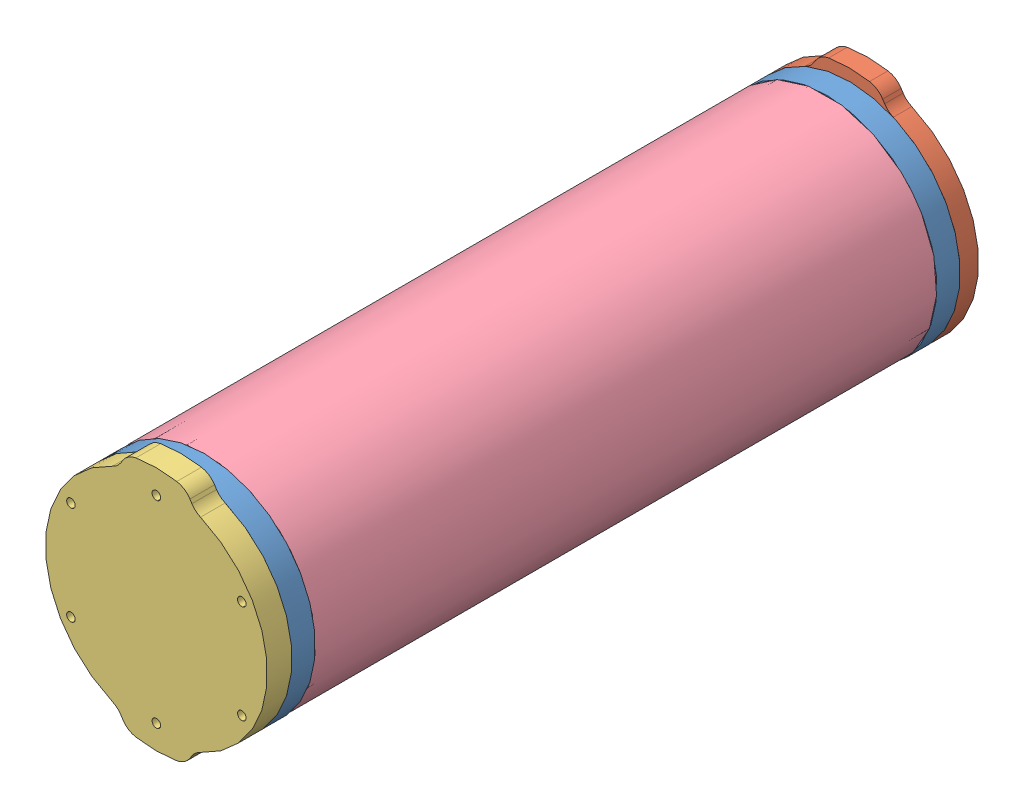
SolidWorks assembly Camera Assembled.SLDASM, configuration Default (file format 11000). Lengths in mm.
Overall size (80.37 80.37 183.11).
14 component instances, 11 part files, 22 mates.
Components (placement in the parent):
- WTE2-M-FLANGE-SEAL-R1-1: WTE2-M-FLANGE-SEAL-R1.SLDPRT [Default] at (-80.4095 50.2357 42.9492) size (57.15 57.15 18.46)
- WTE2-P-END-CAP-2X10MM-R1-1: WTE2-P-END-CAP-2X10MM-R1.SLDPRT [Default] at (-80.4095 50.2357 -115.8133) x (0 1 0) z (0 0 1) size (63.15 57.15 4.76)
- WTE2-P-END-CAP-R1-1: WTE2-P-END-CAP-R1.SLDPRT [Default] at (-80.4095 50.2357 60.9492) x (0 1 0) z (0 0 1) size (63.15 57.15 6.35)
- WTE2-M-FLANGE-SEAL-R1-2: WTE2-M-FLANGE-SEAL-R1.SLDPRT [Default] at (-80.4095 50.2357 -93.0508) x (-0.51521 -0.857064 0) z (0 0 -1) size (57.15 57.15 18.46)
- WTE2-P-TUBE-12-R1_Kip_160mm-1: WTE2-P-TUBE-12-R1_Kip_160mm.SLDPRT [Default] at (-80.4095 50.2357 -25.0508) x (0.77758 0.628784 0) z (0 0 1) size (57.15 57.15 160)
- Kip__Tube_Mount_v4-1: Kip__Tube_Mount_v4.SLDPRT [Default] at (-80.4095 50.2357 67.2992) (suppressed, hidden)
- Kip__Tube_Mount_v4-2: Kip__Tube_Mount_v4.SLDPRT [Default] at (-80.4095 50.2357 -119.8138) (suppressed, hidden)
- See3CAM_CU20-1: See3CAM_CU20.SLDASM [Default] at (-153.4748 38.547 22.1948) size (30 30 33)
  - ee3CAM_CU20 base board-1: ee3CAM_CU20 base board.SLDPRT [Default] at (73.0654 11.6886 8.7544) size (30 30 3)
  - Lens holder-1: Lens holder.SLDPRT [Default] at (73.0654 11.6886 12.7544) x (0 1 0) z (1 0 0) size (16 13 24)
  - See3CAM_CU20 lens-1: See3CAM_CU20 lens.SLDPRT [Default] at (73.0654 11.6886 35.3544) x (0 0 -1) z (1 0 0) size (19.2 18 18)
  - See3CAM_CU20 module board-1: See3CAM_CU20 module board.SLDPRT [Default] at (73.0654 11.6886 11.7544) size (30 30 1)
  - USB 3.1 Micro B-1: USB 3.1 Micro B.SLDPRT [Default] at (74.1387 22.4483 6.2544) x (-1 0 0) z (0 0 -1) size (12.85 3 5)
- SeeCAM 2in tube mount-1: SeeCAM 2in tube mount.SLDPRT [Default] at (-80.4095 50.2357 25.9492) x (0 0 1) z (1 0 0) size (17 50 50)
Mates (geometry in assembly coordinates):
- Coincident2: coincident: plane of WTE2-M-FLANGE-SEAL-R1-1 through (-80.4095 75.2928 54.9492) normal (0 0 -1); plane of WTE2-P-TUBE-12-R1_Kip_160mm-1 through (-80.4095 50.2357 54.9492) normal (0 0 1)
- Concentric8: concentric: cylinder of WTE2-M-FLANGE-SEAL-R1-2 through (-80.4095 50.2357 -93.0508) axis (0 0 1) radius 25.0571; cylinder of WTE2-P-TUBE-12-R1_Kip_160mm-1 through (-80.4095 50.2357 54.9492) axis (0 0 -1) radius 28.575
- Coincident3: coincident: plane of WTE2-M-FLANGE-SEAL-R1-2 through (-101.885 63.1453 -105.0508) normal (0 0 1); plane of WTE2-P-TUBE-12-R1_Kip_160mm-1 through (-80.4095 50.2357 -105.0508) normal (0 0 -1)
- Coincident4: coincident: plane of WTE2-M-FLANGE-SEAL-R1-1 through (-80.4095 78.8107 60.9492) normal (0 0 1); plane of WTE2-P-END-CAP-R1-1 through (-80.4095 50.2357 60.9492) normal (0 0 -1)
- Concentric9: concentric: cylinder of WTE2-M-FLANGE-SEAL-R1-1 through (-80.4095 50.2357 42.9492) axis (0 0 -1) radius 28.575; cylinder of WTE2-P-END-CAP-R1-1 through (-80.4095 50.2357 67.2992) axis (0 0 -1) radius 28.575
- Coincident5: coincident: plane of WTE2-P-END-CAP-2X10MM-R1-1 through (-80.4095 50.2357 -111.0508) normal (0 0 1); plane of WTE2-M-FLANGE-SEAL-R1-2 through (-104.9001 64.9578 -111.0508) normal (0 0 -1)
- Concentric10: concentric: cylinder of WTE2-P-END-CAP-2X10MM-R1-1 through (-80.4095 50.2357 -111.0508) axis (0 0 -1) radius 28.575; cylinder of WTE2-M-FLANGE-SEAL-R1-2 through (-80.4095 50.2357 -93.0508) axis (0 0 1) radius 28.575
- Concentric15: concentric: circle of WTE2-P-END-CAP-R1-1; cylinder of Kip__Tube_Mount_v4-1 through (-99.983 34.048 55.5517) axis (0 0 1) radius 1.8669
- Concentric16: concentric: circle of WTE2-P-END-CAP-R1-1; circle of Kip__Tube_Mount_v4-1
- Coincident13: coincident: circle of WTE2-M-FLANGE-SEAL-R1-1; circle of WTE2-P-TUBE-12-R1_Kip_160mm-1
- Concentric17: concentric: circle of WTE2-P-END-CAP-2X10MM-R1-1; circle of Kip__Tube_Mount_v4-2
- Concentric18: concentric: cylinder of WTE2-P-END-CAP-2X10MM-R1-1 through (-60.836 66.4233 -111.0508) axis (0 0 -1) radius 1.1; circle of Kip__Tube_Mount_v4-2
- Coincident14: coincident: plane of Kip__Tube_Mount_v4-1 through (-87.2574 90.7604 63.3622) normal (-0.16662 0.986021 0); plane of Kip__Tube_Mount_v4-2 through (-87.2574 90.7604 -123.7508) normal (-0.16662 0.986021 0)
- Coincident15: coincident: plane of WTE2-P-END-CAP-2X10MM-R1-1 through (-80.4095 50.2357 -115.8133) normal (0 0 -1); plane of Kip__Tube_Mount_v4-2 through (-80.4095 50.2357 -115.8133) normal (0 0 1)
- Coincident16: coincident: plane of WTE2-P-END-CAP-R1-1 through (-80.4095 50.2357 67.2992) normal (0 0 1); plane of Kip__Tube_Mount_v4-1 through (-80.4095 50.2357 67.2992) normal (0 0 -1)
- Parallel5: parallel: plane of Kip__Tube_Mount_v4-1 through (-80.4095 91.3349 63.3622) normal (0 1 0); plane of assembly through (0 0 0) normal (0 1 0)
- Coincident17: coincident: plane of See3CAM_CU20-1/ee3CAM_CU20 base board-1 through (-80.4095 50.2357 30.9492) normal (0 0 -1); plane of SeeCAM 2in tube mount-1 through (-80.4095 50.2357 30.9492) normal (0 0 1)
- Concentric19: concentric: cylinder of See3CAM_CU20-1/ee3CAM_CU20 base board-1 through (-93.5495 37.0957 30.9492) axis (0 0 1) radius 1; cylinder of SeeCAM 2in tube mount-1 through (-93.5495 37.0957 30.9492) axis (0 0 -1) radius 1
- Concentric20: concentric: cylinder of See3CAM_CU20-1/ee3CAM_CU20 base board-1 through (-67.2695 63.3757 30.9492) axis (0 0 1) radius 1; cylinder of SeeCAM 2in tube mount-1 through (-67.2695 63.3757 30.9492) axis (0 0 -1) radius 1
- Coincident18: coincident: plane of WTE2-M-FLANGE-SEAL-R1-1 through (-80.4095 69.2928 42.9492) normal (0 0 -1); plane of SeeCAM 2in tube mount-1 through (-80.4095 50.2357 42.9492) normal (0 0 1)
- Concentric21: concentric: cylinder of WTE2-M-FLANGE-SEAL-R1-1 through (-80.4095 50.2357 42.9492) axis (0 0 -1) radius 19.0571; cylinder of SeeCAM 2in tube mount-1 through (-80.4095 50.2357 42.9492) axis (0 0 -1) radius 20.6667
- Concentric24: concentric: cylinder of WTE2-M-FLANGE-SEAL-R1-1 through (-58.9095 50.2357 46.9492) axis (0 0 -1) radius 1.25; cylinder of SeeCAM 2in tube mount-1 through (-58.9095 50.2357 25.9492) axis (0 0 1) radius 1.3
